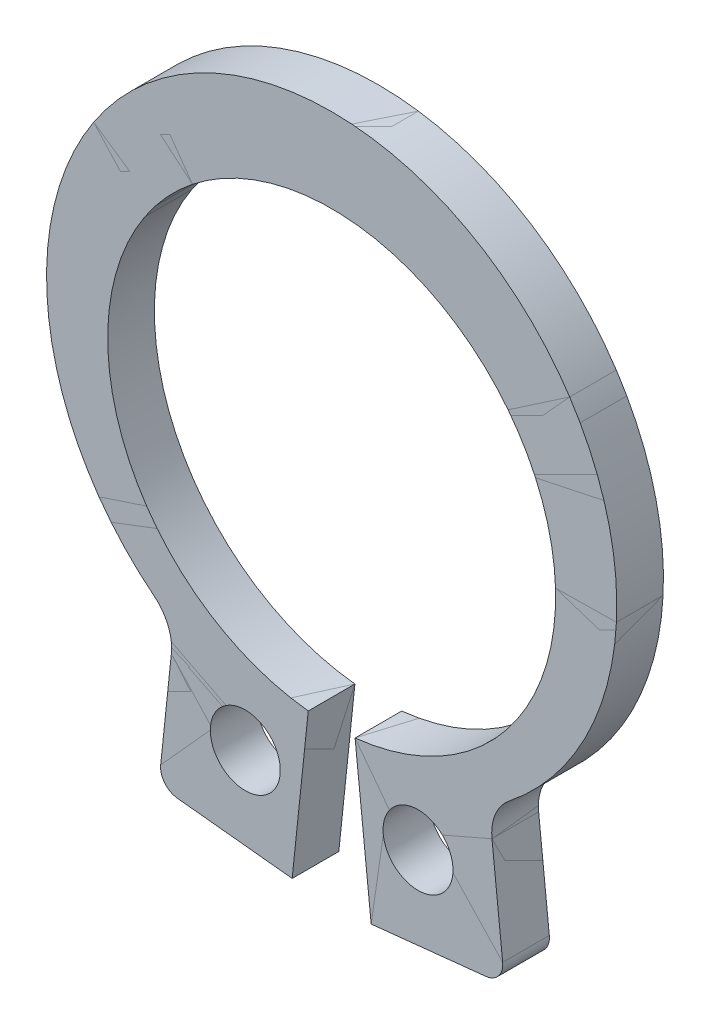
ISO-10303-21;
HEADER;
FILE_DESCRIPTION(('STEP AP214'),'2;1');
FILE_NAME('part.step','',(''),(''),'','','');
FILE_SCHEMA(('AUTOMOTIVE_DESIGN { 1 0 10303 214 1 1 1 1 }'));
ENDSEC;
DATA;
#1=APPLICATION_CONTEXT('core data for automotive mechanical design processes');
#2=APPLICATION_PROTOCOL_DEFINITION('international standard','automotive_design',2000,#1);
#3=PRODUCT_CONTEXT('',#1,'mechanical');
#4=PRODUCT('Part','Part','',(#3));
#5=PRODUCT_RELATED_PRODUCT_CATEGORY('part','',(#4));
#6=PRODUCT_DEFINITION_FORMATION('','',#4);
#7=PRODUCT_DEFINITION_CONTEXT('part definition',#1,'design');
#8=PRODUCT_DEFINITION('design','',#6,#7);
#9=PRODUCT_DEFINITION_SHAPE('','',#8);
#10=(LENGTH_UNIT() NAMED_UNIT(*) SI_UNIT(.MILLI.,.METRE.));
#11=(NAMED_UNIT(*) PLANE_ANGLE_UNIT() SI_UNIT($,.RADIAN.));
#12=(NAMED_UNIT(*) SI_UNIT($,.STERADIAN.) SOLID_ANGLE_UNIT());
#13=UNCERTAINTY_MEASURE_WITH_UNIT(LENGTH_MEASURE(1.E-05),#10,'distance_accuracy_value','');
#14=(GEOMETRIC_REPRESENTATION_CONTEXT(3) GLOBAL_UNCERTAINTY_ASSIGNED_CONTEXT((#13)) GLOBAL_UNIT_ASSIGNED_CONTEXT((#10,
#11,#12)) REPRESENTATION_CONTEXT('',''));
#15=CARTESIAN_POINT('',(0.,0.,0.));
#16=DIRECTION('',(0.,0.,1.));
#17=DIRECTION('',(1.,0.,0.));
#18=AXIS2_PLACEMENT_3D('',#15,#16,#17);
#19=CARTESIAN_POINT('',(0.846680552,-8.055627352,0.));
#20=DIRECTION('',(0.994521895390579,0.10452846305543,0.));
#21=DIRECTION('',(-0.10452846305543,0.994521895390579,0.));
#22=AXIS2_PLACEMENT_3D('',#19,#20,#21);
#23=PLANE('',#22);
#24=DIRECTION('',(0.,0.,1.));
#25=VECTOR('',#24,1.);
#26=CARTESIAN_POINT('',(0.846680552,-8.055627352,0.5));
#27=LINE('',#26,#25);
#28=CARTESIAN_POINT('',(0.846680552,-8.055627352,0.));
#29=VERTEX_POINT('',#28);
#30=CARTESIAN_POINT('',(0.846680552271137,-8.05562735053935,1.));
#31=VERTEX_POINT('',#30);
#32=EDGE_CURVE('P0_E165',#29,#31,#27,.T.);
#33=ORIENTED_EDGE('',*,*,#32,.T.);
#34=DIRECTION('',(0.104528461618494,-0.994521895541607,0.));
#35=VECTOR('',#34,1.);
#36=CARTESIAN_POINT('',(0.501736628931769,-4.77370509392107,1.));
#37=LINE('',#36,#35);
#38=CARTESIAN_POINT('',(0.50173662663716,-4.77370509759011,1.));
#39=VERTEX_POINT('',#38);
#40=EDGE_CURVE('P0_E121',#39,#31,#37,.T.);
#41=ORIENTED_EDGE('',*,*,#40,.F.);
#42=DIRECTION('',(0.,0.,1.));
#43=VECTOR('',#42,1.);
#44=CARTESIAN_POINT('',(0.501736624,-4.773705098,0.5));
#45=LINE('',#44,#43);
#46=CARTESIAN_POINT('',(0.501736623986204,-4.77370509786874,0.));
#47=VERTEX_POINT('',#46);
#48=EDGE_CURVE('P0_E111',#47,#39,#45,.T.);
#49=ORIENTED_EDGE('',*,*,#48,.F.);
#50=DIRECTION('',(-0.10452846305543,0.994521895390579,0.));
#51=VECTOR('',#50,1.);
#52=CARTESIAN_POINT('',(0.846680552,-8.055627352,0.));
#53=LINE('',#52,#51);
#54=EDGE_CURVE('P0_E166',#47,#29,#53,.F.);
#55=ORIENTED_EDGE('',*,*,#54,.T.);
#56=EDGE_LOOP('',(#33,#41,#49,#55));
#57=FACE_BOUND('',#56,.T.);
#58=ADVANCED_FACE('P0_F24',(#57),#23,.F.);
#59=CARTESIAN_POINT('',(3.308644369,-7.796864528,0.));
#60=DIRECTION('',(-0.104528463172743,0.994521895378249,0.));
#61=DIRECTION('',(-0.994521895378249,-0.104528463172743,0.));
#62=AXIS2_PLACEMENT_3D('',#59,#60,#61);
#63=PLANE('',#62);
#64=DIRECTION('',(0.,0.,-1.));
#65=VECTOR('',#64,1.);
#66=CARTESIAN_POINT('',(3.30864436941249,-7.79686452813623,0.5));
#67=LINE('',#66,#65);
#68=CARTESIAN_POINT('',(3.30864436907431,-7.79686452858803,1.));
#69=VERTEX_POINT('',#68);
#70=CARTESIAN_POINT('',(3.30864436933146,-7.79686452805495,0.));
#71=VERTEX_POINT('',#70);
#72=EDGE_CURVE('P0_E169',#69,#71,#67,.T.);
#73=ORIENTED_EDGE('',*,*,#72,.F.);
#74=DIRECTION('',(0.994521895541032,0.104528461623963,0.));
#75=VECTOR('',#74,1.);
#76=CARTESIAN_POINT('',(0.846680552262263,-8.05562734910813,1.));
#77=LINE('',#76,#75);
#78=EDGE_CURVE('P0_E159',#31,#69,#77,.T.);
#79=ORIENTED_EDGE('',*,*,#78,.F.);
#80=ORIENTED_EDGE('',*,*,#32,.F.);
#81=DIRECTION('',(-0.994521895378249,-0.104528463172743,0.));
#82=VECTOR('',#81,1.);
#83=CARTESIAN_POINT('',(3.308644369,-7.796864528,0.));
#84=LINE('',#83,#82);
#85=EDGE_CURVE('P0_E174',#29,#71,#84,.F.);
#86=ORIENTED_EDGE('',*,*,#85,.T.);
#87=EDGE_LOOP('',(#73,#79,#80,#86));
#88=FACE_BOUND('',#87,.T.);
#89=ADVANCED_FACE('P0_F171',(#88),#63,.F.);
#90=CARTESIAN_POINT('',(3.266832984,-7.39905577,1.));
#91=DIRECTION('',(0.,0.,-1.));
#92=DIRECTION('',(-1.,0.,0.));
#93=AXIS2_PLACEMENT_3D('',#90,#91,#92);
#94=CYLINDRICAL_SURFACE('',#93,0.400000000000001);
#95=CARTESIAN_POINT('',(3.266832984,-7.39905577,1.));
#96=DIRECTION('',(0.,0.,-1.));
#97=DIRECTION('',(-1.,0.,0.));
#98=AXIS2_PLACEMENT_3D('',#95,#96,#97);
#99=CIRCLE('',#98,0.400000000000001);
#100=CARTESIAN_POINT('',(3.66464174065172,-7.35724438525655,1.));
#101=VERTEX_POINT('',#100);
#102=EDGE_CURVE('P0_E156',#69,#101,#99,.F.);
#103=ORIENTED_EDGE('',*,*,#102,.F.);
#104=ORIENTED_EDGE('',*,*,#72,.T.);
#105=CARTESIAN_POINT('',(3.266832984,-7.39905577,0.));
#106=DIRECTION('',(0.,0.,-1.));
#107=DIRECTION('',(-1.,0.,0.));
#108=AXIS2_PLACEMENT_3D('',#105,#106,#107);
#109=CIRCLE('',#108,0.400000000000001);
#110=CARTESIAN_POINT('',(3.66464174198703,-7.35724438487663,0.));
#111=VERTEX_POINT('',#110);
#112=EDGE_CURVE('P0_E224',#71,#111,#109,.F.);
#113=ORIENTED_EDGE('',*,*,#112,.T.);
#114=DIRECTION('',(0.,0.,1.));
#115=VECTOR('',#114,1.);
#116=CARTESIAN_POINT('',(3.664641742,-7.357244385,0.5));
#117=LINE('',#116,#115);
#118=EDGE_CURVE('P0_E177',#111,#101,#117,.T.);
#119=ORIENTED_EDGE('',*,*,#118,.T.);
#120=EDGE_LOOP('',(#103,#104,#113,#119));
#121=FACE_BOUND('',#120,.T.);
#122=ADVANCED_FACE('P0_F179',(#121),#94,.T.);
#123=CARTESIAN_POINT('',(3.435512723,-5.177227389,0.));
#124=DIRECTION('',(-0.994521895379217,-0.104528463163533,0.));
#125=DIRECTION('',(0.104528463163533,-0.994521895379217,0.));
#126=AXIS2_PLACEMENT_3D('',#123,#124,#125);
#127=PLANE('',#126);
#128=DIRECTION('',(0.,0.,1.));
#129=VECTOR('',#128,1.);
#130=CARTESIAN_POINT('',(3.43551272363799,-5.17722738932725,0.5));
#131=LINE('',#130,#129);
#132=CARTESIAN_POINT('',(3.43551272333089,-5.17722738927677,0.));
#133=VERTEX_POINT('',#132);
#134=CARTESIAN_POINT('',(3.43551272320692,-5.17722738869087,1.));
#135=VERTEX_POINT('',#134);
#136=EDGE_CURVE('P0_E188',#133,#135,#131,.T.);
#137=ORIENTED_EDGE('',*,*,#136,.T.);
#138=DIRECTION('',(-0.104528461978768,0.994521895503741,0.));
#139=VECTOR('',#138,1.);
#140=CARTESIAN_POINT('',(3.66464173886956,-7.3572443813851,1.));
#141=LINE('',#140,#139);
#142=EDGE_CURVE('P0_E153',#101,#135,#141,.T.);
#143=ORIENTED_EDGE('',*,*,#142,.F.);
#144=ORIENTED_EDGE('',*,*,#118,.F.);
#145=DIRECTION('',(0.104528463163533,-0.994521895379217,0.));
#146=VECTOR('',#145,1.);
#147=CARTESIAN_POINT('',(3.435512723,-5.177227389,0.));
#148=LINE('',#147,#146);
#149=EDGE_CURVE('P0_E189',#111,#133,#148,.F.);
#150=ORIENTED_EDGE('',*,*,#149,.T.);
#151=EDGE_LOOP('',(#137,#143,#144,#150));
#152=FACE_BOUND('',#151,.T.);
#153=ADVANCED_FACE('P0_F184',(#152),#127,.F.);
#154=CARTESIAN_POINT('',(4.430034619,-5.072698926,1.));
#155=DIRECTION('',(0.,0.,-1.));
#156=DIRECTION('',(-1.,0.,0.));
#157=AXIS2_PLACEMENT_3D('',#154,#155,#156);
#158=CYLINDRICAL_SURFACE('',#157,1.);
#159=CARTESIAN_POINT('',(4.430034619,-5.072698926,1.));
#160=DIRECTION('',(0.,0.,-1.));
#161=DIRECTION('',(-1.,0.,0.));
#162=AXIS2_PLACEMENT_3D('',#159,#160,#161);
#163=CIRCLE('',#162,1.);
#164=CARTESIAN_POINT('',(3.80702147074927,-4.29048756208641,1.));
#165=VERTEX_POINT('',#164);
#166=EDGE_CURVE('P0_E150',#135,#165,#163,.T.);
#167=ORIENTED_EDGE('',*,*,#166,.F.);
#168=ORIENTED_EDGE('',*,*,#136,.F.);
#169=CARTESIAN_POINT('',(4.430034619,-5.072698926,0.));
#170=DIRECTION('',(0.,0.,-1.));
#171=DIRECTION('',(-1.,0.,0.));
#172=AXIS2_PLACEMENT_3D('',#169,#170,#171);
#173=CIRCLE('',#172,1.);
#174=CARTESIAN_POINT('',(3.80702147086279,-4.29048756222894,0.));
#175=VERTEX_POINT('',#174);
#176=EDGE_CURVE('P0_E221',#133,#175,#173,.T.);
#177=ORIENTED_EDGE('',*,*,#176,.T.);
#178=DIRECTION('',(0.,0.,-1.));
#179=VECTOR('',#178,1.);
#180=CARTESIAN_POINT('',(3.8070214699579,-4.29048756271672,0.5));
#181=LINE('',#180,#179);
#182=EDGE_CURVE('P0_E192',#165,#175,#181,.T.);
#183=ORIENTED_EDGE('',*,*,#182,.F.);
#184=EDGE_LOOP('',(#167,#168,#177,#183));
#185=FACE_BOUND('',#184,.T.);
#186=ADVANCED_FACE('P0_F256',(#185),#158,.F.);
#187=CARTESIAN_POINT('',(0.,0.489340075,1.));
#188=DIRECTION('',(0.,0.,-1.));
#189=DIRECTION('',(-1.,0.,0.));
#190=AXIS2_PLACEMENT_3D('',#187,#188,#189);
#191=CYLINDRICAL_SURFACE('',#190,6.110659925);
#192=CARTESIAN_POINT('',(0.,0.489340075,0.));
#193=DIRECTION('',(0.,0.,-1.));
#194=DIRECTION('',(-1.,0.,0.));
#195=AXIS2_PLACEMENT_3D('',#192,#193,#194);
#196=CIRCLE('',#195,6.110659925);
#197=CARTESIAN_POINT('',(-3.80702147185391,-4.29048756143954,0.));
#198=VERTEX_POINT('',#197);
#199=EDGE_CURVE('P0_E219',#175,#198,#196,.F.);
#200=ORIENTED_EDGE('',*,*,#199,.T.);
#201=DIRECTION('',(0.,0.,1.));
#202=VECTOR('',#201,1.);
#203=CARTESIAN_POINT('',(-3.80702147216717,-4.29048756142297,0.5));
#204=LINE('',#203,#202);
#205=CARTESIAN_POINT('',(-3.80702147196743,-4.29048756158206,1.));
#206=VERTEX_POINT('',#205);
#207=EDGE_CURVE('P0_E195',#198,#206,#204,.T.);
#208=ORIENTED_EDGE('',*,*,#207,.T.);
#209=CARTESIAN_POINT('',(0.,0.489340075,1.));
#210=DIRECTION('',(0.,0.,-1.));
#211=DIRECTION('',(-1.,0.,0.));
#212=AXIS2_PLACEMENT_3D('',#209,#210,#211);
#213=CIRCLE('',#212,6.110659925);
#214=EDGE_CURVE('P0_E147',#165,#206,#213,.F.);
#215=ORIENTED_EDGE('',*,*,#214,.F.);
#216=ORIENTED_EDGE('',*,*,#182,.T.);
#217=EDGE_LOOP('',(#200,#208,#215,#216));
#218=FACE_BOUND('',#217,.T.);
#219=ADVANCED_FACE('P0_F240',(#218),#191,.T.);
#220=CARTESIAN_POINT('',(-4.430034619,-5.072698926,1.));
#221=DIRECTION('',(0.,0.,-1.));
#222=DIRECTION('',(-1.,0.,0.));
#223=AXIS2_PLACEMENT_3D('',#220,#221,#222);
#224=CYLINDRICAL_SURFACE('',#223,1.);
#225=DIRECTION('',(0.,0.,1.));
#226=VECTOR('',#225,1.);
#227=CARTESIAN_POINT('',(-3.435512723,-5.177227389,0.5));
#228=LINE('',#227,#226);
#229=CARTESIAN_POINT('',(-3.43551272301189,-5.17722738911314,0.));
#230=VERTEX_POINT('',#229);
#231=CARTESIAN_POINT('',(-3.43551272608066,-5.17722738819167,1.));
#232=VERTEX_POINT('',#231);
#233=EDGE_CURVE('P0_E128',#230,#232,#228,.T.);
#234=ORIENTED_EDGE('',*,*,#233,.T.);
#235=CARTESIAN_POINT('',(-4.430034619,-5.072698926,1.));
#236=DIRECTION('',(0.,0.,-1.));
#237=DIRECTION('',(-1.,0.,0.));
#238=AXIS2_PLACEMENT_3D('',#235,#236,#237);
#239=CIRCLE('',#238,1.);
#240=EDGE_CURVE('P0_E141',#206,#232,#239,.T.);
#241=ORIENTED_EDGE('',*,*,#240,.F.);
#242=ORIENTED_EDGE('',*,*,#207,.F.);
#243=CARTESIAN_POINT('',(-4.430034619,-5.072698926,0.));
#244=DIRECTION('',(0.,0.,-1.));
#245=DIRECTION('',(-1.,0.,0.));
#246=AXIS2_PLACEMENT_3D('',#243,#244,#245);
#247=CIRCLE('',#246,1.);
#248=EDGE_CURVE('P0_E217',#198,#230,#247,.T.);
#249=ORIENTED_EDGE('',*,*,#248,.T.);
#250=EDGE_LOOP('',(#234,#241,#242,#249));
#251=FACE_BOUND('',#250,.T.);
#252=ADVANCED_FACE('P0_F244',(#251),#224,.F.);
#253=CARTESIAN_POINT('',(-3.664641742,-7.357244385,0.));
#254=DIRECTION('',(0.994521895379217,-0.104528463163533,0.));
#255=DIRECTION('',(0.104528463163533,0.994521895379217,0.));
#256=AXIS2_PLACEMENT_3D('',#253,#254,#255);
#257=PLANE('',#256);
#258=DIRECTION('',(0.,0.,-1.));
#259=VECTOR('',#258,1.);
#260=CARTESIAN_POINT('',(-3.66464174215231,-7.35724438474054,0.5));
#261=LINE('',#260,#259);
#262=CARTESIAN_POINT('',(-3.6646417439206,-7.35724438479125,1.));
#263=VERTEX_POINT('',#262);
#264=CARTESIAN_POINT('',(-3.66464174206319,-7.3572443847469,0.));
#265=VERTEX_POINT('',#264);
#266=EDGE_CURVE('P0_E227',#263,#265,#261,.T.);
#267=ORIENTED_EDGE('',*,*,#266,.F.);
#268=DIRECTION('',(-0.104528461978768,-0.994521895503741,0.));
#269=VECTOR('',#268,1.);
#270=CARTESIAN_POINT('',(-3.43551272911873,-5.17722738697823,1.));
#271=LINE('',#270,#269);
#272=EDGE_CURVE('P0_E135',#232,#263,#271,.T.);
#273=ORIENTED_EDGE('',*,*,#272,.F.);
#274=ORIENTED_EDGE('',*,*,#233,.F.);
#275=DIRECTION('',(0.104528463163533,0.994521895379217,0.));
#276=VECTOR('',#275,1.);
#277=CARTESIAN_POINT('',(-3.664641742,-7.357244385,0.));
#278=LINE('',#277,#276);
#279=EDGE_CURVE('P0_E214',#230,#265,#278,.F.);
#280=ORIENTED_EDGE('',*,*,#279,.T.);
#281=EDGE_LOOP('',(#267,#273,#274,#280));
#282=FACE_BOUND('',#281,.T.);
#283=ADVANCED_FACE('P0_F248',(#282),#257,.F.);
#284=CARTESIAN_POINT('',(0.,0.,1.));
#285=DIRECTION('',(0.,0.,-1.));
#286=DIRECTION('',(-1.,0.,0.));
#287=AXIS2_PLACEMENT_3D('',#284,#285,#286);
#288=CYLINDRICAL_SURFACE('',#287,4.8);
#289=CARTESIAN_POINT('',(0.,0.,1.));
#290=DIRECTION('',(0.,0.,-1.));
#291=DIRECTION('',(-1.,0.,0.));
#292=AXIS2_PLACEMENT_3D('',#289,#290,#291);
#293=CIRCLE('',#292,4.8);
#294=CARTESIAN_POINT('',(-0.501736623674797,-4.77370509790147,1.));
#295=VERTEX_POINT('',#294);
#296=EDGE_CURVE('P0_E28',#295,#39,#293,.T.);
#297=ORIENTED_EDGE('',*,*,#296,.F.);
#298=DIRECTION('',(0.,0.,-1.));
#299=VECTOR('',#298,1.);
#300=CARTESIAN_POINT('',(-0.501736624,-4.773705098,0.5));
#301=LINE('',#300,#299);
#302=CARTESIAN_POINT('',(-0.501736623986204,-4.77370509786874,0.));
#303=VERTEX_POINT('',#302);
#304=EDGE_CURVE('P0_E116',#295,#303,#301,.T.);
#305=ORIENTED_EDGE('',*,*,#304,.T.);
#306=CARTESIAN_POINT('',(0.,0.,0.));
#307=DIRECTION('',(0.,0.,-1.));
#308=DIRECTION('',(-1.,0.,0.));
#309=AXIS2_PLACEMENT_3D('',#306,#307,#308);
#310=CIRCLE('',#309,4.8);
#311=EDGE_CURVE('P0_E211',#303,#47,#310,.T.);
#312=ORIENTED_EDGE('',*,*,#311,.T.);
#313=ORIENTED_EDGE('',*,*,#48,.T.);
#314=EDGE_LOOP('',(#297,#305,#312,#313));
#315=FACE_BOUND('',#314,.T.);
#316=ADVANCED_FACE('P0_F115',(#315),#288,.F.);
#317=CARTESIAN_POINT('',(1.850774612,-6.17876471,1.));
#318=DIRECTION('',(0.,0.,-1.));
#319=DIRECTION('',(-1.,0.,0.));
#320=AXIS2_PLACEMENT_3D('',#317,#318,#319);
#321=CYLINDRICAL_SURFACE('',#320,0.75);
#322=CARTESIAN_POINT('',(1.850774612,-6.17876471,0.));
#323=DIRECTION('',(0.,0.,-1.));
#324=DIRECTION('',(-1.,0.,0.));
#325=AXIS2_PLACEMENT_3D('',#322,#323,#324);
#326=CIRCLE('',#325,0.75);
#327=CARTESIAN_POINT('',(1.100774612,-6.17876471,0.));
#328=VERTEX_POINT('',#327);
#329=EDGE_CURVE('P0_E208',#328,#328,#326,.T.);
#330=ORIENTED_EDGE('',*,*,#329,.T.);
#331=EDGE_LOOP('',(#330));
#332=FACE_BOUND('',#331,.T.);
#333=CARTESIAN_POINT('',(1.850774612,-6.17876471,1.));
#334=DIRECTION('',(0.,0.,-1.));
#335=DIRECTION('',(-1.,0.,0.));
#336=AXIS2_PLACEMENT_3D('',#333,#334,#335);
#337=CIRCLE('',#336,0.75);
#338=CARTESIAN_POINT('',(1.100774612,-6.17876471,1.));
#339=VERTEX_POINT('',#338);
#340=EDGE_CURVE('P0_E134',#339,#339,#337,.T.);
#341=ORIENTED_EDGE('',*,*,#340,.F.);
#342=EDGE_LOOP('',(#341));
#343=FACE_BOUND('',#342,.T.);
#344=ADVANCED_FACE('P0_F292',(#332,#343),#321,.F.);
#345=CARTESIAN_POINT('',(-1.850774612,-6.17876471,1.));
#346=DIRECTION('',(0.,0.,-1.));
#347=DIRECTION('',(-1.,0.,0.));
#348=AXIS2_PLACEMENT_3D('',#345,#346,#347);
#349=CYLINDRICAL_SURFACE('',#348,0.75);
#350=CARTESIAN_POINT('',(-1.850774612,-6.17876471,0.));
#351=DIRECTION('',(0.,0.,-1.));
#352=DIRECTION('',(-1.,0.,0.));
#353=AXIS2_PLACEMENT_3D('',#350,#351,#352);
#354=CIRCLE('',#353,0.75);
#355=CARTESIAN_POINT('',(-2.600774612,-6.17876471,0.));
#356=VERTEX_POINT('',#355);
#357=EDGE_CURVE('P0_E205',#356,#356,#354,.T.);
#358=ORIENTED_EDGE('',*,*,#357,.T.);
#359=EDGE_LOOP('',(#358));
#360=FACE_BOUND('',#359,.T.);
#361=CARTESIAN_POINT('',(-1.850774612,-6.17876471,1.));
#362=DIRECTION('',(0.,0.,-1.));
#363=DIRECTION('',(-1.,0.,0.));
#364=AXIS2_PLACEMENT_3D('',#361,#362,#363);
#365=CIRCLE('',#364,0.75);
#366=CARTESIAN_POINT('',(-2.600774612,-6.17876471,1.));
#367=VERTEX_POINT('',#366);
#368=EDGE_CURVE('P0_E138',#367,#367,#365,.T.);
#369=ORIENTED_EDGE('',*,*,#368,.F.);
#370=EDGE_LOOP('',(#369));
#371=FACE_BOUND('',#370,.T.);
#372=ADVANCED_FACE('P0_F273',(#360,#371),#349,.F.);
#373=CARTESIAN_POINT('',(-0.501736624,-4.773705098,0.));
#374=DIRECTION('',(-0.994521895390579,0.10452846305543,0.));
#375=DIRECTION('',(-0.10452846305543,-0.994521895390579,0.));
#376=AXIS2_PLACEMENT_3D('',#373,#374,#375);
#377=PLANE('',#376);
#378=ORIENTED_EDGE('',*,*,#304,.F.);
#379=DIRECTION('',(0.104528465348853,0.99452189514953,0.));
#380=VECTOR('',#379,1.);
#381=CARTESIAN_POINT('',(-0.846680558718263,-8.05562734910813,1.));
#382=LINE('',#381,#380);
#383=CARTESIAN_POINT('',(-0.846680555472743,-8.055627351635,1.));
#384=VERTEX_POINT('',#383);
#385=EDGE_CURVE('P0_E124',#384,#295,#382,.T.);
#386=ORIENTED_EDGE('',*,*,#385,.F.);
#387=DIRECTION('',(0.,0.,-1.));
#388=VECTOR('',#387,1.);
#389=CARTESIAN_POINT('',(-0.846680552,-8.055627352,0.5));
#390=LINE('',#389,#388);
#391=CARTESIAN_POINT('',(-0.846680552,-8.055627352,0.));
#392=VERTEX_POINT('',#391);
#393=EDGE_CURVE('P0_E253',#384,#392,#390,.T.);
#394=ORIENTED_EDGE('',*,*,#393,.T.);
#395=DIRECTION('',(-0.10452846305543,-0.994521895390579,0.));
#396=VECTOR('',#395,1.);
#397=CARTESIAN_POINT('',(-0.501736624,-4.773705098,0.));
#398=LINE('',#397,#396);
#399=EDGE_CURVE('P0_E126',#392,#303,#398,.F.);
#400=ORIENTED_EDGE('',*,*,#399,.T.);
#401=EDGE_LOOP('',(#378,#386,#394,#400));
#402=FACE_BOUND('',#401,.T.);
#403=ADVANCED_FACE('P0_F123',(#402),#377,.F.);
#404=CARTESIAN_POINT('',(-6.211815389,-8.14380868,1.));
#405=DIRECTION('',(0.,0.,1.));
#406=DIRECTION('',(1.,0.,0.));
#407=AXIS2_PLACEMENT_3D('',#404,#405,#406);
#408=PLANE('',#407);
#409=ORIENTED_EDGE('',*,*,#368,.T.);
#410=EDGE_LOOP('',(#409));
#411=FACE_BOUND('',#410,.T.);
#412=ORIENTED_EDGE('',*,*,#340,.T.);
#413=EDGE_LOOP('',(#412));
#414=FACE_BOUND('',#413,.T.);
#415=DIRECTION('',(0.994521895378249,-0.104528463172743,0.));
#416=VECTOR('',#415,1.);
#417=CARTESIAN_POINT('',(-2.0776624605,-7.92624594,1.));
#418=LINE('',#417,#416);
#419=CARTESIAN_POINT('',(-3.30864436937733,-7.79686452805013,1.));
#420=VERTEX_POINT('',#419);
#421=EDGE_CURVE('P0_E132',#420,#384,#418,.T.);
#422=ORIENTED_EDGE('',*,*,#421,.T.);
#423=ORIENTED_EDGE('',*,*,#385,.T.);
#424=ORIENTED_EDGE('',*,*,#296,.T.);
#425=ORIENTED_EDGE('',*,*,#40,.T.);
#426=ORIENTED_EDGE('',*,*,#78,.T.);
#427=ORIENTED_EDGE('',*,*,#102,.T.);
#428=ORIENTED_EDGE('',*,*,#142,.T.);
#429=ORIENTED_EDGE('',*,*,#166,.T.);
#430=ORIENTED_EDGE('',*,*,#214,.T.);
#431=ORIENTED_EDGE('',*,*,#240,.T.);
#432=ORIENTED_EDGE('',*,*,#272,.T.);
#433=CARTESIAN_POINT('',(-3.266832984,-7.39905577,1.));
#434=DIRECTION('',(0.,0.,-1.));
#435=DIRECTION('',(-1.,0.,0.));
#436=AXIS2_PLACEMENT_3D('',#433,#434,#435);
#437=CIRCLE('',#436,0.4);
#438=EDGE_CURVE('P0_E203',#420,#263,#437,.T.);
#439=ORIENTED_EDGE('',*,*,#438,.F.);
#440=EDGE_LOOP('',(#422,#423,#424,#425,#426,#427,#428,#429,#430,#431,#432,#439));
#441=FACE_BOUND('',#440,.T.);
#442=ADVANCED_FACE('P0_F130',(#411,#414,#441),#408,.T.);
#443=CARTESIAN_POINT('',(-6.211815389,-8.14380868,0.));
#444=DIRECTION('',(0.,0.,1.));
#445=DIRECTION('',(1.,0.,0.));
#446=AXIS2_PLACEMENT_3D('',#443,#444,#445);
#447=PLANE('',#446);
#448=ORIENTED_EDGE('',*,*,#357,.F.);
#449=EDGE_LOOP('',(#448));
#450=FACE_BOUND('',#449,.T.);
#451=ORIENTED_EDGE('',*,*,#329,.F.);
#452=EDGE_LOOP('',(#451));
#453=FACE_BOUND('',#452,.T.);
#454=ORIENTED_EDGE('',*,*,#399,.F.);
#455=DIRECTION('',(-0.994521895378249,0.104528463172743,0.));
#456=VECTOR('',#455,1.);
#457=CARTESIAN_POINT('',(-2.0776624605,-7.92624594,0.));
#458=LINE('',#457,#456);
#459=CARTESIAN_POINT('',(-3.30864436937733,-7.79686452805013,0.));
#460=VERTEX_POINT('',#459);
#461=EDGE_CURVE('P0_E43',#392,#460,#458,.T.);
#462=ORIENTED_EDGE('',*,*,#461,.T.);
#463=CARTESIAN_POINT('',(-3.266832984,-7.39905577,0.));
#464=DIRECTION('',(0.,0.,-1.));
#465=DIRECTION('',(-1.,0.,0.));
#466=AXIS2_PLACEMENT_3D('',#463,#464,#465);
#467=CIRCLE('',#466,0.4);
#468=EDGE_CURVE('P0_E34',#265,#460,#467,.F.);
#469=ORIENTED_EDGE('',*,*,#468,.F.);
#470=ORIENTED_EDGE('',*,*,#279,.F.);
#471=ORIENTED_EDGE('',*,*,#248,.F.);
#472=ORIENTED_EDGE('',*,*,#199,.F.);
#473=ORIENTED_EDGE('',*,*,#176,.F.);
#474=ORIENTED_EDGE('',*,*,#149,.F.);
#475=ORIENTED_EDGE('',*,*,#112,.F.);
#476=ORIENTED_EDGE('',*,*,#85,.F.);
#477=ORIENTED_EDGE('',*,*,#54,.F.);
#478=ORIENTED_EDGE('',*,*,#311,.F.);
#479=EDGE_LOOP('',(#454,#462,#469,#470,#471,#472,#473,#474,#475,#476,#477,#478));
#480=FACE_BOUND('',#479,.T.);
#481=ADVANCED_FACE('P0_F250',(#450,#453,#480),#447,.F.);
#482=CARTESIAN_POINT('',(-0.846680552,-8.055627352,0.));
#483=DIRECTION('',(0.104528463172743,0.994521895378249,0.));
#484=DIRECTION('',(-0.994521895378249,0.104528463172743,0.));
#485=AXIS2_PLACEMENT_3D('',#482,#483,#484);
#486=PLANE('',#485);
#487=ORIENTED_EDGE('',*,*,#393,.F.);
#488=ORIENTED_EDGE('',*,*,#421,.F.);
#489=DIRECTION('',(0.,0.,1.));
#490=VECTOR('',#489,1.);
#491=CARTESIAN_POINT('',(-3.30864436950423,-7.79686452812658,0.5));
#492=LINE('',#491,#490);
#493=EDGE_CURVE('P0_E11',#460,#420,#492,.T.);
#494=ORIENTED_EDGE('',*,*,#493,.F.);
#495=ORIENTED_EDGE('',*,*,#461,.F.);
#496=EDGE_LOOP('',(#487,#488,#494,#495));
#497=FACE_BOUND('',#496,.T.);
#498=ADVANCED_FACE('P0_F26',(#497),#486,.F.);
#499=CARTESIAN_POINT('',(-3.266832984,-7.39905577,1.));
#500=DIRECTION('',(0.,0.,-1.));
#501=DIRECTION('',(-1.,0.,0.));
#502=AXIS2_PLACEMENT_3D('',#499,#500,#501);
#503=CYLINDRICAL_SURFACE('',#502,0.4);
#504=ORIENTED_EDGE('',*,*,#468,.T.);
#505=ORIENTED_EDGE('',*,*,#493,.T.);
#506=ORIENTED_EDGE('',*,*,#438,.T.);
#507=ORIENTED_EDGE('',*,*,#266,.T.);
#508=EDGE_LOOP('',(#504,#505,#506,#507));
#509=FACE_BOUND('',#508,.T.);
#510=ADVANCED_FACE('P0_F251',(#509),#503,.T.);
#511=CLOSED_SHELL('',(#58,#89,#122,#153,#186,#219,#252,#283,#316,#344,#372,#403,#442,#481,#498,#510));
#512=MANIFOLD_SOLID_BREP('P0_B2',#511);
#513=CARTESIAN_POINT('',(0.846680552,-8.055627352,0.));
#514=DIRECTION('',(0.994521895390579,0.10452846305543,0.));
#515=DIRECTION('',(-0.10452846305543,0.994521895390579,0.));
#516=AXIS2_PLACEMENT_3D('',#513,#514,#515);
#517=PLANE('',#516);
#518=DIRECTION('',(0.,0.,1.));
#519=VECTOR('',#518,1.);
#520=CARTESIAN_POINT('',(0.846680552,-8.055627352,0.5));
#521=LINE('',#520,#519);
#522=CARTESIAN_POINT('',(0.846680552,-8.055627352,0.));
#523=VERTEX_POINT('',#522);
#524=CARTESIAN_POINT('',(0.846680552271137,-8.05562735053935,1.));
#525=VERTEX_POINT('',#524);
#526=EDGE_CURVE('P1_E156',#523,#525,#521,.T.);
#527=ORIENTED_EDGE('',*,*,#526,.T.);
#528=DIRECTION('',(0.104528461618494,-0.994521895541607,0.));
#529=VECTOR('',#528,1.);
#530=CARTESIAN_POINT('',(0.501736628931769,-4.77370509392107,1.));
#531=LINE('',#530,#529);
#532=CARTESIAN_POINT('',(0.50173662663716,-4.77370509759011,1.));
#533=VERTEX_POINT('',#532);
#534=EDGE_CURVE('P1_E112',#533,#525,#531,.T.);
#535=ORIENTED_EDGE('',*,*,#534,.F.);
#536=DIRECTION('',(0.,0.,1.));
#537=VECTOR('',#536,1.);
#538=CARTESIAN_POINT('',(0.501736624,-4.773705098,0.5));
#539=LINE('',#538,#537);
#540=CARTESIAN_POINT('',(0.501736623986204,-4.77370509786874,0.));
#541=VERTEX_POINT('',#540);
#542=EDGE_CURVE('P1_E102',#541,#533,#539,.T.);
#543=ORIENTED_EDGE('',*,*,#542,.F.);
#544=DIRECTION('',(-0.10452846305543,0.994521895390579,0.));
#545=VECTOR('',#544,1.);
#546=CARTESIAN_POINT('',(0.846680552,-8.055627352,0.));
#547=LINE('',#546,#545);
#548=EDGE_CURVE('P1_E157',#541,#523,#547,.F.);
#549=ORIENTED_EDGE('',*,*,#548,.T.);
#550=EDGE_LOOP('',(#527,#535,#543,#549));
#551=FACE_BOUND('',#550,.T.);
#552=ADVANCED_FACE('P1_F15',(#551),#517,.F.);
#553=CARTESIAN_POINT('',(3.308644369,-7.796864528,0.));
#554=DIRECTION('',(-0.104528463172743,0.994521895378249,0.));
#555=DIRECTION('',(-0.994521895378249,-0.104528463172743,0.));
#556=AXIS2_PLACEMENT_3D('',#553,#554,#555);
#557=PLANE('',#556);
#558=DIRECTION('',(0.,0.,-1.));
#559=VECTOR('',#558,1.);
#560=CARTESIAN_POINT('',(3.30864436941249,-7.79686452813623,0.5));
#561=LINE('',#560,#559);
#562=CARTESIAN_POINT('',(3.30864436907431,-7.79686452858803,1.));
#563=VERTEX_POINT('',#562);
#564=CARTESIAN_POINT('',(3.30864436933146,-7.79686452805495,0.));
#565=VERTEX_POINT('',#564);
#566=EDGE_CURVE('P1_E160',#563,#565,#561,.T.);
#567=ORIENTED_EDGE('',*,*,#566,.F.);
#568=DIRECTION('',(0.994521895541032,0.104528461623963,0.));
#569=VECTOR('',#568,1.);
#570=CARTESIAN_POINT('',(0.846680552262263,-8.05562734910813,1.));
#571=LINE('',#570,#569);
#572=EDGE_CURVE('P1_E150',#525,#563,#571,.T.);
#573=ORIENTED_EDGE('',*,*,#572,.F.);
#574=ORIENTED_EDGE('',*,*,#526,.F.);
#575=DIRECTION('',(-0.994521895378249,-0.104528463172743,0.));
#576=VECTOR('',#575,1.);
#577=CARTESIAN_POINT('',(3.308644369,-7.796864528,0.));
#578=LINE('',#577,#576);
#579=EDGE_CURVE('P1_E165',#523,#565,#578,.F.);
#580=ORIENTED_EDGE('',*,*,#579,.T.);
#581=EDGE_LOOP('',(#567,#573,#574,#580));
#582=FACE_BOUND('',#581,.T.);
#583=ADVANCED_FACE('P1_F162',(#582),#557,.F.);
#584=CARTESIAN_POINT('',(3.266832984,-7.39905577,1.));
#585=DIRECTION('',(0.,0.,-1.));
#586=DIRECTION('',(-1.,0.,0.));
#587=AXIS2_PLACEMENT_3D('',#584,#585,#586);
#588=CYLINDRICAL_SURFACE('',#587,0.400000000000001);
#589=CARTESIAN_POINT('',(3.266832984,-7.39905577,1.));
#590=DIRECTION('',(0.,0.,-1.));
#591=DIRECTION('',(-1.,0.,0.));
#592=AXIS2_PLACEMENT_3D('',#589,#590,#591);
#593=CIRCLE('',#592,0.400000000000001);
#594=CARTESIAN_POINT('',(3.66464174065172,-7.35724438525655,1.));
#595=VERTEX_POINT('',#594);
#596=EDGE_CURVE('P1_E147',#563,#595,#593,.F.);
#597=ORIENTED_EDGE('',*,*,#596,.F.);
#598=ORIENTED_EDGE('',*,*,#566,.T.);
#599=CARTESIAN_POINT('',(3.266832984,-7.39905577,0.));
#600=DIRECTION('',(0.,0.,-1.));
#601=DIRECTION('',(-1.,0.,0.));
#602=AXIS2_PLACEMENT_3D('',#599,#600,#601);
#603=CIRCLE('',#602,0.400000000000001);
#604=CARTESIAN_POINT('',(3.66464174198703,-7.35724438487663,0.));
#605=VERTEX_POINT('',#604);
#606=EDGE_CURVE('P1_E215',#565,#605,#603,.F.);
#607=ORIENTED_EDGE('',*,*,#606,.T.);
#608=DIRECTION('',(0.,0.,1.));
#609=VECTOR('',#608,1.);
#610=CARTESIAN_POINT('',(3.664641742,-7.357244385,0.5));
#611=LINE('',#610,#609);
#612=EDGE_CURVE('P1_E168',#605,#595,#611,.T.);
#613=ORIENTED_EDGE('',*,*,#612,.T.);
#614=EDGE_LOOP('',(#597,#598,#607,#613));
#615=FACE_BOUND('',#614,.T.);
#616=ADVANCED_FACE('P1_F170',(#615),#588,.T.);
#617=CARTESIAN_POINT('',(3.435512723,-5.177227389,0.));
#618=DIRECTION('',(-0.994521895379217,-0.104528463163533,0.));
#619=DIRECTION('',(0.104528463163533,-0.994521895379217,0.));
#620=AXIS2_PLACEMENT_3D('',#617,#618,#619);
#621=PLANE('',#620);
#622=DIRECTION('',(0.,0.,1.));
#623=VECTOR('',#622,1.);
#624=CARTESIAN_POINT('',(3.43551272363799,-5.17722738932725,0.5));
#625=LINE('',#624,#623);
#626=CARTESIAN_POINT('',(3.43551272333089,-5.17722738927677,0.));
#627=VERTEX_POINT('',#626);
#628=CARTESIAN_POINT('',(3.43551272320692,-5.17722738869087,1.));
#629=VERTEX_POINT('',#628);
#630=EDGE_CURVE('P1_E179',#627,#629,#625,.T.);
#631=ORIENTED_EDGE('',*,*,#630,.T.);
#632=DIRECTION('',(-0.104528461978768,0.994521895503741,0.));
#633=VECTOR('',#632,1.);
#634=CARTESIAN_POINT('',(3.66464173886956,-7.3572443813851,1.));
#635=LINE('',#634,#633);
#636=EDGE_CURVE('P1_E144',#595,#629,#635,.T.);
#637=ORIENTED_EDGE('',*,*,#636,.F.);
#638=ORIENTED_EDGE('',*,*,#612,.F.);
#639=DIRECTION('',(0.104528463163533,-0.994521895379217,0.));
#640=VECTOR('',#639,1.);
#641=CARTESIAN_POINT('',(3.435512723,-5.177227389,0.));
#642=LINE('',#641,#640);
#643=EDGE_CURVE('P1_E180',#605,#627,#642,.F.);
#644=ORIENTED_EDGE('',*,*,#643,.T.);
#645=EDGE_LOOP('',(#631,#637,#638,#644));
#646=FACE_BOUND('',#645,.T.);
#647=ADVANCED_FACE('P1_F175',(#646),#621,.F.);
#648=CARTESIAN_POINT('',(4.430034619,-5.072698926,1.));
#649=DIRECTION('',(0.,0.,-1.));
#650=DIRECTION('',(-1.,0.,0.));
#651=AXIS2_PLACEMENT_3D('',#648,#649,#650);
#652=CYLINDRICAL_SURFACE('',#651,1.);
#653=CARTESIAN_POINT('',(4.430034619,-5.072698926,1.));
#654=DIRECTION('',(0.,0.,-1.));
#655=DIRECTION('',(-1.,0.,0.));
#656=AXIS2_PLACEMENT_3D('',#653,#654,#655);
#657=CIRCLE('',#656,1.);
#658=CARTESIAN_POINT('',(3.80702147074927,-4.29048756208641,1.));
#659=VERTEX_POINT('',#658);
#660=EDGE_CURVE('P1_E141',#629,#659,#657,.T.);
#661=ORIENTED_EDGE('',*,*,#660,.F.);
#662=ORIENTED_EDGE('',*,*,#630,.F.);
#663=CARTESIAN_POINT('',(4.430034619,-5.072698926,0.));
#664=DIRECTION('',(0.,0.,-1.));
#665=DIRECTION('',(-1.,0.,0.));
#666=AXIS2_PLACEMENT_3D('',#663,#664,#665);
#667=CIRCLE('',#666,1.);
#668=CARTESIAN_POINT('',(3.80702147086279,-4.29048756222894,0.));
#669=VERTEX_POINT('',#668);
#670=EDGE_CURVE('P1_E212',#627,#669,#667,.T.);
#671=ORIENTED_EDGE('',*,*,#670,.T.);
#672=DIRECTION('',(0.,0.,-1.));
#673=VECTOR('',#672,1.);
#674=CARTESIAN_POINT('',(3.8070214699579,-4.29048756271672,0.5));
#675=LINE('',#674,#673);
#676=EDGE_CURVE('P1_E183',#659,#669,#675,.T.);
#677=ORIENTED_EDGE('',*,*,#676,.F.);
#678=EDGE_LOOP('',(#661,#662,#671,#677));
#679=FACE_BOUND('',#678,.T.);
#680=ADVANCED_FACE('P1_F247',(#679),#652,.F.);
#681=CARTESIAN_POINT('',(0.,0.489340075,1.));
#682=DIRECTION('',(0.,0.,-1.));
#683=DIRECTION('',(-1.,0.,0.));
#684=AXIS2_PLACEMENT_3D('',#681,#682,#683);
#685=CYLINDRICAL_SURFACE('',#684,6.110659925);
#686=CARTESIAN_POINT('',(0.,0.489340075,0.));
#687=DIRECTION('',(0.,0.,-1.));
#688=DIRECTION('',(-1.,0.,0.));
#689=AXIS2_PLACEMENT_3D('',#686,#687,#688);
#690=CIRCLE('',#689,6.110659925);
#691=CARTESIAN_POINT('',(-3.80702147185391,-4.29048756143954,0.));
#692=VERTEX_POINT('',#691);
#693=EDGE_CURVE('P1_E210',#669,#692,#690,.F.);
#694=ORIENTED_EDGE('',*,*,#693,.T.);
#695=DIRECTION('',(0.,0.,1.));
#696=VECTOR('',#695,1.);
#697=CARTESIAN_POINT('',(-3.80702147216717,-4.29048756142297,0.5));
#698=LINE('',#697,#696);
#699=CARTESIAN_POINT('',(-3.80702147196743,-4.29048756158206,1.));
#700=VERTEX_POINT('',#699);
#701=EDGE_CURVE('P1_E186',#692,#700,#698,.T.);
#702=ORIENTED_EDGE('',*,*,#701,.T.);
#703=CARTESIAN_POINT('',(0.,0.489340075,1.));
#704=DIRECTION('',(0.,0.,-1.));
#705=DIRECTION('',(-1.,0.,0.));
#706=AXIS2_PLACEMENT_3D('',#703,#704,#705);
#707=CIRCLE('',#706,6.110659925);
#708=EDGE_CURVE('P1_E138',#659,#700,#707,.F.);
#709=ORIENTED_EDGE('',*,*,#708,.F.);
#710=ORIENTED_EDGE('',*,*,#676,.T.);
#711=EDGE_LOOP('',(#694,#702,#709,#710));
#712=FACE_BOUND('',#711,.T.);
#713=ADVANCED_FACE('P1_F231',(#712),#685,.T.);
#714=CARTESIAN_POINT('',(-4.430034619,-5.072698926,1.));
#715=DIRECTION('',(0.,0.,-1.));
#716=DIRECTION('',(-1.,0.,0.));
#717=AXIS2_PLACEMENT_3D('',#714,#715,#716);
#718=CYLINDRICAL_SURFACE('',#717,1.);
#719=DIRECTION('',(0.,0.,1.));
#720=VECTOR('',#719,1.);
#721=CARTESIAN_POINT('',(-3.435512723,-5.177227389,0.5));
#722=LINE('',#721,#720);
#723=CARTESIAN_POINT('',(-3.43551272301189,-5.17722738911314,0.));
#724=VERTEX_POINT('',#723);
#725=CARTESIAN_POINT('',(-3.43551272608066,-5.17722738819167,1.));
#726=VERTEX_POINT('',#725);
#727=EDGE_CURVE('P1_E119',#724,#726,#722,.T.);
#728=ORIENTED_EDGE('',*,*,#727,.T.);
#729=CARTESIAN_POINT('',(-4.430034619,-5.072698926,1.));
#730=DIRECTION('',(0.,0.,-1.));
#731=DIRECTION('',(-1.,0.,0.));
#732=AXIS2_PLACEMENT_3D('',#729,#730,#731);
#733=CIRCLE('',#732,1.);
#734=EDGE_CURVE('P1_E132',#700,#726,#733,.T.);
#735=ORIENTED_EDGE('',*,*,#734,.F.);
#736=ORIENTED_EDGE('',*,*,#701,.F.);
#737=CARTESIAN_POINT('',(-4.430034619,-5.072698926,0.));
#738=DIRECTION('',(0.,0.,-1.));
#739=DIRECTION('',(-1.,0.,0.));
#740=AXIS2_PLACEMENT_3D('',#737,#738,#739);
#741=CIRCLE('',#740,1.);
#742=EDGE_CURVE('P1_E208',#692,#724,#741,.T.);
#743=ORIENTED_EDGE('',*,*,#742,.T.);
#744=EDGE_LOOP('',(#728,#735,#736,#743));
#745=FACE_BOUND('',#744,.T.);
#746=ADVANCED_FACE('P1_F235',(#745),#718,.F.);
#747=CARTESIAN_POINT('',(-3.664641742,-7.357244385,0.));
#748=DIRECTION('',(0.994521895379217,-0.104528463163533,0.));
#749=DIRECTION('',(0.104528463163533,0.994521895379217,0.));
#750=AXIS2_PLACEMENT_3D('',#747,#748,#749);
#751=PLANE('',#750);
#752=DIRECTION('',(0.,0.,-1.));
#753=VECTOR('',#752,1.);
#754=CARTESIAN_POINT('',(-3.66464174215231,-7.35724438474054,0.5));
#755=LINE('',#754,#753);
#756=CARTESIAN_POINT('',(-3.6646417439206,-7.35724438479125,1.));
#757=VERTEX_POINT('',#756);
#758=CARTESIAN_POINT('',(-3.66464174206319,-7.3572443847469,0.));
#759=VERTEX_POINT('',#758);
#760=EDGE_CURVE('P1_E218',#757,#759,#755,.T.);
#761=ORIENTED_EDGE('',*,*,#760,.F.);
#762=DIRECTION('',(-0.104528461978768,-0.994521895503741,0.));
#763=VECTOR('',#762,1.);
#764=CARTESIAN_POINT('',(-3.43551272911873,-5.17722738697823,1.));
#765=LINE('',#764,#763);
#766=EDGE_CURVE('P1_E126',#726,#757,#765,.T.);
#767=ORIENTED_EDGE('',*,*,#766,.F.);
#768=ORIENTED_EDGE('',*,*,#727,.F.);
#769=DIRECTION('',(0.104528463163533,0.994521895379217,0.));
#770=VECTOR('',#769,1.);
#771=CARTESIAN_POINT('',(-3.664641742,-7.357244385,0.));
#772=LINE('',#771,#770);
#773=EDGE_CURVE('P1_E205',#724,#759,#772,.F.);
#774=ORIENTED_EDGE('',*,*,#773,.T.);
#775=EDGE_LOOP('',(#761,#767,#768,#774));
#776=FACE_BOUND('',#775,.T.);
#777=ADVANCED_FACE('P1_F239',(#776),#751,.F.);
#778=CARTESIAN_POINT('',(0.,0.,1.));
#779=DIRECTION('',(0.,0.,-1.));
#780=DIRECTION('',(-1.,0.,0.));
#781=AXIS2_PLACEMENT_3D('',#778,#779,#780);
#782=CYLINDRICAL_SURFACE('',#781,4.8);
#783=CARTESIAN_POINT('',(0.,0.,1.));
#784=DIRECTION('',(0.,0.,-1.));
#785=DIRECTION('',(-1.,0.,0.));
#786=AXIS2_PLACEMENT_3D('',#783,#784,#785);
#787=CIRCLE('',#786,4.8);
#788=CARTESIAN_POINT('',(-0.501736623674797,-4.77370509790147,1.));
#789=VERTEX_POINT('',#788);
#790=EDGE_CURVE('P1_E19',#789,#533,#787,.T.);
#791=ORIENTED_EDGE('',*,*,#790,.F.);
#792=DIRECTION('',(0.,0.,-1.));
#793=VECTOR('',#792,1.);
#794=CARTESIAN_POINT('',(-0.501736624,-4.773705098,0.5));
#795=LINE('',#794,#793);
#796=CARTESIAN_POINT('',(-0.501736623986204,-4.77370509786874,0.));
#797=VERTEX_POINT('',#796);
#798=EDGE_CURVE('P1_E107',#789,#797,#795,.T.);
#799=ORIENTED_EDGE('',*,*,#798,.T.);
#800=CARTESIAN_POINT('',(0.,0.,0.));
#801=DIRECTION('',(0.,0.,-1.));
#802=DIRECTION('',(-1.,0.,0.));
#803=AXIS2_PLACEMENT_3D('',#800,#801,#802);
#804=CIRCLE('',#803,4.8);
#805=EDGE_CURVE('P1_E202',#797,#541,#804,.T.);
#806=ORIENTED_EDGE('',*,*,#805,.T.);
#807=ORIENTED_EDGE('',*,*,#542,.T.);
#808=EDGE_LOOP('',(#791,#799,#806,#807));
#809=FACE_BOUND('',#808,.T.);
#810=ADVANCED_FACE('P1_F106',(#809),#782,.F.);
#811=CARTESIAN_POINT('',(1.850774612,-6.17876471,1.));
#812=DIRECTION('',(0.,0.,-1.));
#813=DIRECTION('',(-1.,0.,0.));
#814=AXIS2_PLACEMENT_3D('',#811,#812,#813);
#815=CYLINDRICAL_SURFACE('',#814,0.75);
#816=CARTESIAN_POINT('',(1.850774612,-6.17876471,0.));
#817=DIRECTION('',(0.,0.,-1.));
#818=DIRECTION('',(-1.,0.,0.));
#819=AXIS2_PLACEMENT_3D('',#816,#817,#818);
#820=CIRCLE('',#819,0.75);
#821=CARTESIAN_POINT('',(1.100774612,-6.17876471,0.));
#822=VERTEX_POINT('',#821);
#823=EDGE_CURVE('P1_E199',#822,#822,#820,.T.);
#824=ORIENTED_EDGE('',*,*,#823,.T.);
#825=EDGE_LOOP('',(#824));
#826=FACE_BOUND('',#825,.T.);
#827=CARTESIAN_POINT('',(1.850774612,-6.17876471,1.));
#828=DIRECTION('',(0.,0.,-1.));
#829=DIRECTION('',(-1.,0.,0.));
#830=AXIS2_PLACEMENT_3D('',#827,#828,#829);
#831=CIRCLE('',#830,0.75);
#832=CARTESIAN_POINT('',(1.100774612,-6.17876471,1.));
#833=VERTEX_POINT('',#832);
#834=EDGE_CURVE('P1_E125',#833,#833,#831,.T.);
#835=ORIENTED_EDGE('',*,*,#834,.F.);
#836=EDGE_LOOP('',(#835));
#837=FACE_BOUND('',#836,.T.);
#838=ADVANCED_FACE('P1_F284',(#826,#837),#815,.F.);
#839=CARTESIAN_POINT('',(-1.850774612,-6.17876471,1.));
#840=DIRECTION('',(0.,0.,-1.));
#841=DIRECTION('',(-1.,0.,0.));
#842=AXIS2_PLACEMENT_3D('',#839,#840,#841);
#843=CYLINDRICAL_SURFACE('',#842,0.75);
#844=CARTESIAN_POINT('',(-1.850774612,-6.17876471,0.));
#845=DIRECTION('',(0.,0.,-1.));
#846=DIRECTION('',(-1.,0.,0.));
#847=AXIS2_PLACEMENT_3D('',#844,#845,#846);
#848=CIRCLE('',#847,0.75);
#849=CARTESIAN_POINT('',(-2.600774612,-6.17876471,0.));
#850=VERTEX_POINT('',#849);
#851=EDGE_CURVE('P1_E196',#850,#850,#848,.T.);
#852=ORIENTED_EDGE('',*,*,#851,.T.);
#853=EDGE_LOOP('',(#852));
#854=FACE_BOUND('',#853,.T.);
#855=CARTESIAN_POINT('',(-1.850774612,-6.17876471,1.));
#856=DIRECTION('',(0.,0.,-1.));
#857=DIRECTION('',(-1.,0.,0.));
#858=AXIS2_PLACEMENT_3D('',#855,#856,#857);
#859=CIRCLE('',#858,0.75);
#860=CARTESIAN_POINT('',(-2.600774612,-6.17876471,1.));
#861=VERTEX_POINT('',#860);
#862=EDGE_CURVE('P1_E129',#861,#861,#859,.T.);
#863=ORIENTED_EDGE('',*,*,#862,.F.);
#864=EDGE_LOOP('',(#863));
#865=FACE_BOUND('',#864,.T.);
#866=ADVANCED_FACE('P1_F265',(#854,#865),#843,.F.);
#867=CARTESIAN_POINT('',(-0.501736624,-4.773705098,0.));
#868=DIRECTION('',(-0.994521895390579,0.10452846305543,0.));
#869=DIRECTION('',(-0.10452846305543,-0.994521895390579,0.));
#870=AXIS2_PLACEMENT_3D('',#867,#868,#869);
#871=PLANE('',#870);
#872=ORIENTED_EDGE('',*,*,#798,.F.);
#873=DIRECTION('',(0.104528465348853,0.99452189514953,0.));
#874=VECTOR('',#873,1.);
#875=CARTESIAN_POINT('',(-0.846680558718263,-8.05562734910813,1.));
#876=LINE('',#875,#874);
#877=CARTESIAN_POINT('',(-0.846680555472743,-8.055627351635,1.));
#878=VERTEX_POINT('',#877);
#879=EDGE_CURVE('P1_E115',#878,#789,#876,.T.);
#880=ORIENTED_EDGE('',*,*,#879,.F.);
#881=DIRECTION('',(0.,0.,-1.));
#882=VECTOR('',#881,1.);
#883=CARTESIAN_POINT('',(-0.846680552,-8.055627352,0.5));
#884=LINE('',#883,#882);
#885=CARTESIAN_POINT('',(-0.846680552,-8.055627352,0.));
#886=VERTEX_POINT('',#885);
#887=EDGE_CURVE('P1_E244',#878,#886,#884,.T.);
#888=ORIENTED_EDGE('',*,*,#887,.T.);
#889=DIRECTION('',(-0.10452846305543,-0.994521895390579,0.));
#890=VECTOR('',#889,1.);
#891=CARTESIAN_POINT('',(-0.501736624,-4.773705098,0.));
#892=LINE('',#891,#890);
#893=EDGE_CURVE('P1_E117',#886,#797,#892,.F.);
#894=ORIENTED_EDGE('',*,*,#893,.T.);
#895=EDGE_LOOP('',(#872,#880,#888,#894));
#896=FACE_BOUND('',#895,.T.);
#897=ADVANCED_FACE('P1_F114',(#896),#871,.F.);
#898=CARTESIAN_POINT('',(-6.211815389,-8.14380868,1.));
#899=DIRECTION('',(0.,0.,1.));
#900=DIRECTION('',(1.,0.,0.));
#901=AXIS2_PLACEMENT_3D('',#898,#899,#900);
#902=PLANE('',#901);
#903=ORIENTED_EDGE('',*,*,#862,.T.);
#904=EDGE_LOOP('',(#903));
#905=FACE_BOUND('',#904,.T.);
#906=ORIENTED_EDGE('',*,*,#834,.T.);
#907=EDGE_LOOP('',(#906));
#908=FACE_BOUND('',#907,.T.);
#909=DIRECTION('',(0.994521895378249,-0.104528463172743,0.));
#910=VECTOR('',#909,1.);
#911=CARTESIAN_POINT('',(-2.0776624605,-7.92624594,1.));
#912=LINE('',#911,#910);
#913=CARTESIAN_POINT('',(-3.30864436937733,-7.79686452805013,1.));
#914=VERTEX_POINT('',#913);
#915=EDGE_CURVE('P1_E123',#914,#878,#912,.T.);
#916=ORIENTED_EDGE('',*,*,#915,.T.);
#917=ORIENTED_EDGE('',*,*,#879,.T.);
#918=ORIENTED_EDGE('',*,*,#790,.T.);
#919=ORIENTED_EDGE('',*,*,#534,.T.);
#920=ORIENTED_EDGE('',*,*,#572,.T.);
#921=ORIENTED_EDGE('',*,*,#596,.T.);
#922=ORIENTED_EDGE('',*,*,#636,.T.);
#923=ORIENTED_EDGE('',*,*,#660,.T.);
#924=ORIENTED_EDGE('',*,*,#708,.T.);
#925=ORIENTED_EDGE('',*,*,#734,.T.);
#926=ORIENTED_EDGE('',*,*,#766,.T.);
#927=CARTESIAN_POINT('',(-3.266832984,-7.39905577,1.));
#928=DIRECTION('',(0.,0.,-1.));
#929=DIRECTION('',(-1.,0.,0.));
#930=AXIS2_PLACEMENT_3D('',#927,#928,#929);
#931=CIRCLE('',#930,0.4);
#932=EDGE_CURVE('P1_E194',#914,#757,#931,.T.);
#933=ORIENTED_EDGE('',*,*,#932,.F.);
#934=EDGE_LOOP('',(#916,#917,#918,#919,#920,#921,#922,#923,#924,#925,#926,#933));
#935=FACE_BOUND('',#934,.T.);
#936=ADVANCED_FACE('P1_F121',(#905,#908,#935),#902,.T.);
#937=CARTESIAN_POINT('',(-6.211815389,-8.14380868,0.));
#938=DIRECTION('',(0.,0.,1.));
#939=DIRECTION('',(1.,0.,0.));
#940=AXIS2_PLACEMENT_3D('',#937,#938,#939);
#941=PLANE('',#940);
#942=ORIENTED_EDGE('',*,*,#851,.F.);
#943=EDGE_LOOP('',(#942));
#944=FACE_BOUND('',#943,.T.);
#945=ORIENTED_EDGE('',*,*,#823,.F.);
#946=EDGE_LOOP('',(#945));
#947=FACE_BOUND('',#946,.T.);
#948=ORIENTED_EDGE('',*,*,#893,.F.);
#949=DIRECTION('',(-0.994521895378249,0.104528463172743,0.));
#950=VECTOR('',#949,1.);
#951=CARTESIAN_POINT('',(-2.0776624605,-7.92624594,0.));
#952=LINE('',#951,#950);
#953=CARTESIAN_POINT('',(-3.30864436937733,-7.79686452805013,0.));
#954=VERTEX_POINT('',#953);
#955=EDGE_CURVE('P1_E34',#886,#954,#952,.T.);
#956=ORIENTED_EDGE('',*,*,#955,.T.);
#957=CARTESIAN_POINT('',(-3.266832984,-7.39905577,0.));
#958=DIRECTION('',(0.,0.,-1.));
#959=DIRECTION('',(-1.,0.,0.));
#960=AXIS2_PLACEMENT_3D('',#957,#958,#959);
#961=CIRCLE('',#960,0.4);
#962=EDGE_CURVE('P1_E25',#759,#954,#961,.F.);
#963=ORIENTED_EDGE('',*,*,#962,.F.);
#964=ORIENTED_EDGE('',*,*,#773,.F.);
#965=ORIENTED_EDGE('',*,*,#742,.F.);
#966=ORIENTED_EDGE('',*,*,#693,.F.);
#967=ORIENTED_EDGE('',*,*,#670,.F.);
#968=ORIENTED_EDGE('',*,*,#643,.F.);
#969=ORIENTED_EDGE('',*,*,#606,.F.);
#970=ORIENTED_EDGE('',*,*,#579,.F.);
#971=ORIENTED_EDGE('',*,*,#548,.F.);
#972=ORIENTED_EDGE('',*,*,#805,.F.);
#973=EDGE_LOOP('',(#948,#956,#963,#964,#965,#966,#967,#968,#969,#970,#971,#972));
#974=FACE_BOUND('',#973,.T.);
#975=ADVANCED_FACE('P1_F241',(#944,#947,#974),#941,.F.);
#976=CARTESIAN_POINT('',(-0.846680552,-8.055627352,0.));
#977=DIRECTION('',(0.104528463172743,0.994521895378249,0.));
#978=DIRECTION('',(-0.994521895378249,0.104528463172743,0.));
#979=AXIS2_PLACEMENT_3D('',#976,#977,#978);
#980=PLANE('',#979);
#981=ORIENTED_EDGE('',*,*,#887,.F.);
#982=ORIENTED_EDGE('',*,*,#915,.F.);
#983=DIRECTION('',(0.,0.,1.));
#984=VECTOR('',#983,1.);
#985=CARTESIAN_POINT('',(-3.30864436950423,-7.79686452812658,0.5));
#986=LINE('',#985,#984);
#987=EDGE_CURVE('P1_E10',#954,#914,#986,.T.);
#988=ORIENTED_EDGE('',*,*,#987,.F.);
#989=ORIENTED_EDGE('',*,*,#955,.F.);
#990=EDGE_LOOP('',(#981,#982,#988,#989));
#991=FACE_BOUND('',#990,.T.);
#992=ADVANCED_FACE('P1_F17',(#991),#980,.F.);
#993=CARTESIAN_POINT('',(-3.266832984,-7.39905577,1.));
#994=DIRECTION('',(0.,0.,-1.));
#995=DIRECTION('',(-1.,0.,0.));
#996=AXIS2_PLACEMENT_3D('',#993,#994,#995);
#997=CYLINDRICAL_SURFACE('',#996,0.4);
#998=ORIENTED_EDGE('',*,*,#962,.T.);
#999=ORIENTED_EDGE('',*,*,#987,.T.);
#1000=ORIENTED_EDGE('',*,*,#932,.T.);
#1001=ORIENTED_EDGE('',*,*,#760,.T.);
#1002=EDGE_LOOP('',(#998,#999,#1000,#1001));
#1003=FACE_BOUND('',#1002,.T.);
#1004=ADVANCED_FACE('P1_F242',(#1003),#997,.T.);
#1005=CLOSED_SHELL('',(#552,#583,#616,#647,#680,#713,#746,#777,#810,#838,#866,#897,#936,#975,
#992,#1004));
#1006=MANIFOLD_SOLID_BREP('P1_B1',#1005);
#1007=ADVANCED_BREP_SHAPE_REPRESENTATION('',(#18,#512,#1006),#14);
#1008=SHAPE_DEFINITION_REPRESENTATION(#9,#1007);
ENDSEC;
END-ISO-10303-21;
